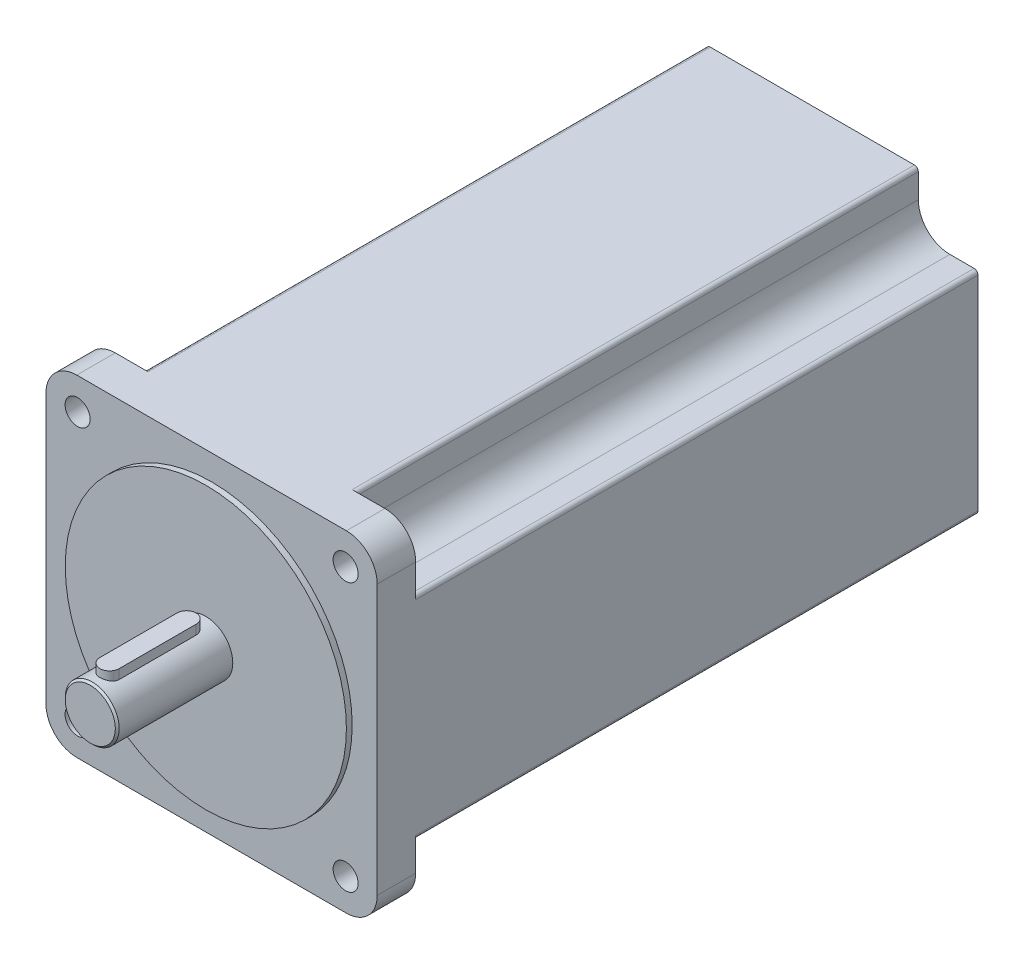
from build123d import *

# Parameters (mm, degrees)
SKETCH_1_R          = 36.5
EXTRUDE_1_DEPTH     = 1.5
SKETCH_2_R          = 7
EXTRUDE_2_DEPTH     = 30
SKETCH_4_R          = 3.25
EXTRUDE_3_DEPTH     = 156
CUT_EXTRUDE_2_DEPTH = 146
CUT_EXTRUDE_3_DEPTH = 3
EXTRUDE_4_DEPTH     = 5
CHAMFER_1_SIZE      = 0.5


with BuildPart() as part:
    # Sketch 1 → Extrude 1 (new body)
    with BuildSketch(Plane.XY):
        Circle(SKETCH_1_R)
    extrude(amount=-EXTRUDE_1_DEPTH)

    # Sketch 2 → Extrude 2 (add)
    with BuildSketch(Plane.XY):
        Circle(SKETCH_2_R)
    extrude(amount=EXTRUDE_2_DEPTH)

    # Sketch 4 → Extrude 3 (add)
    with BuildSketch(Plane(origin=(0, 0, -1.5), x_dir=(-1, 0, 0), z_dir=(0, 0, -1))):
        with BuildLine():
            Line((0, 43), (35, 43))
            ThreePointArc((35, 43), (40.656854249, 40.656854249), (43, 35))
            Line((43, 35), (43, -35))
            ThreePointArc((43, -35), (40.656854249, -40.656854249), (35, -43))
            Line((35, -43), (-35, -43))
            ThreePointArc((-35, -43), (-40.656854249, -40.656854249), (-43, -35))
            Line((-43, -35), (-43, 35))
            ThreePointArc((-43, 35), (-40.656854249, 40.656854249), (-35, 43))
            Line((-35, 43), (0, 43))
        make_face()
        with Locations((-34.8, 34.8)):
            Circle(SKETCH_4_R, mode=Mode.SUBTRACT)
        with Locations((34.8, 34.8)):
            Circle(SKETCH_4_R, mode=Mode.SUBTRACT)
        with Locations((34.8, -34.8)):
            Circle(SKETCH_4_R, mode=Mode.SUBTRACT)
        with Locations((-34.8, -34.8)):
            Circle(SKETCH_4_R, mode=Mode.SUBTRACT)
    extrude(amount=EXTRUDE_3_DEPTH)

    # Sketch 5 → Cut-Extrude 2 (cut)
    with BuildSketch(Plane(origin=(0, 0, -157.5), x_dir=(-1, 0, 0), z_dir=(0, 0, -1))):
        with BuildLine():
            Line((13.75, 43), (26.5, 43))
            ThreePointArc((26.5, 43), (27.207106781, 42.707106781), (27.5, 42))
            Line((27.5, 42), (27.5, 35.7))
            ThreePointArc((27.5, 35.7), (29.901724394, 29.901724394), (35.7, 27.5))
            Line((35.7, 27.5), (42, 27.5))
            ThreePointArc((42, 27.5), (42.707106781, 27.207106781), (43, 26.5))
            Line((43, 26.5), (43, 18.140986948))
            Line((43, 18.140986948), (50.571489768, 18.140986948))
            Line((50.571489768, 18.140986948), (50.571489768, 56.827618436))
            Line((50.571489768, 56.827618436), (13.75, 56.827618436))
            Line((13.75, 56.827618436), (13.75, 43))
        make_face()
        with BuildLine():
            Line((-13.75, 56.827618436), (-13.75, 43))
            Line((-13.75, 43), (-26.5, 43))
            ThreePointArc((-26.5, 43), (-27.207106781, 42.707106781), (-27.5, 42))
            Line((-27.5, 42), (-27.5, 35.7))
            ThreePointArc((-27.5, 35.7), (-29.901724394, 29.901724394), (-35.7, 27.5))
            Line((-35.7, 27.5), (-42, 27.5))
            ThreePointArc((-42, 27.5), (-42.707106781, 27.207106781), (-43, 26.5))
            Line((-43, 26.5), (-43, 18.140986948))
            Line((-43, 18.140986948), (-50.571489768, 18.140986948))
            Line((-50.571489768, 18.140986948), (-50.571489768, 56.827618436))
            Line((-50.571489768, 56.827618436), (-13.75, 56.827618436))
        make_face()
        with BuildLine():
            Line((13.75, -56.827618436), (13.75, -43))
            Line((13.75, -43), (26.5, -43))
            ThreePointArc((26.5, -43), (27.207106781, -42.707106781), (27.5, -42))
            Line((27.5, -42), (27.5, -35.7))
            ThreePointArc((27.5, -35.7), (29.901724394, -29.901724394), (35.7, -27.5))
            Line((35.7, -27.5), (42, -27.5))
            ThreePointArc((42, -27.5), (42.707106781, -27.207106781), (43, -26.5))
            Line((43, -26.5), (43, -18.140986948))
            Line((43, -18.140986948), (50.571489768, -18.140986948))
            Line((50.571489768, -18.140986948), (50.571489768, -56.827618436))
            Line((50.571489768, -56.827618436), (13.75, -56.827618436))
        make_face()
        with BuildLine():
            Line((-13.75, -43), (-26.5, -43))
            ThreePointArc((-26.5, -43), (-27.207106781, -42.707106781), (-27.5, -42))
            Line((-27.5, -42), (-27.5, -35.7))
            ThreePointArc((-27.5, -35.7), (-29.901724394, -29.901724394), (-35.7, -27.5))
            Line((-35.7, -27.5), (-42, -27.5))
            ThreePointArc((-42, -27.5), (-42.707106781, -27.207106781), (-43, -26.5))
            Line((-43, -26.5), (-43, -18.140986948))
            Line((-43, -18.140986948), (-50.571489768, -18.140986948))
            Line((-50.571489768, -18.140986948), (-50.571489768, -56.827618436))
            Line((-50.571489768, -56.827618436), (-13.75, -56.827618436))
            Line((-13.75, -56.827618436), (-13.75, -43))
        make_face()
    extrude(amount=-CUT_EXTRUDE_2_DEPTH, mode=Mode.SUBTRACT)

    # Sketch 6 → Cut-Extrude 3 (cut)
    with BuildSketch(Plane(origin=(0, 7, 0), x_dir=(1, 0, 0), z_dir=(0, 1, 0))):
        with BuildLine():
            Line((-2.5, -5), (-2.5, -25))
            ThreePointArc((-2.5, -25), (0, -27.5), (2.5, -25))
            Line((2.5, -25), (2.5, -5))
            ThreePointArc((2.5, -5), (0, -2.5), (-2.5, -5))
        make_face()
    extrude(amount=-CUT_EXTRUDE_3_DEPTH, mode=Mode.SUBTRACT)

    # Chamfer 1
    chamfer_1_edges = [part.edges().sort_by_distance(p)[0] for p in [
        (-7, 0, 30),
    ]]
    chamfer(chamfer_1_edges, length=CHAMFER_1_SIZE)


with BuildPart() as body_2:
    # Sketch 7 → Extrude 4 (new body)
    with BuildSketch(Plane(origin=(0, 4, 0), x_dir=(1, 0, 0), z_dir=(0, 1, 0))):
        with BuildLine():
            Line((-2.5, -25), (-2.5, -5))
            ThreePointArc((-2.5, -5), (0, -2.5), (2.5, -5))
            Line((2.5, -5), (2.5, -25))
            ThreePointArc((2.5, -25), (0, -27.5), (-2.5, -25))
        make_face()
    extrude(amount=EXTRUDE_4_DEPTH)


solid = Compound([part.part, body_2.part])
